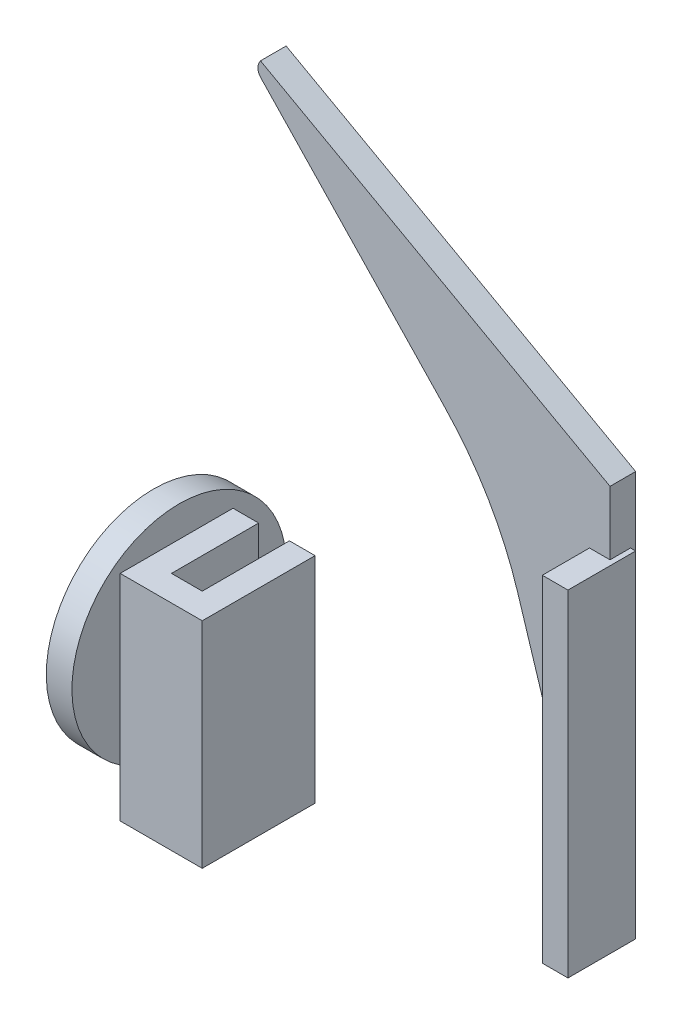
ISO-10303-21;
HEADER;
FILE_DESCRIPTION(('STEP AP214'),'2;1');
FILE_NAME('part.step','',(''),(''),'','','');
FILE_SCHEMA(('AUTOMOTIVE_DESIGN { 1 0 10303 214 1 1 1 1 }'));
ENDSEC;
DATA;
#1=APPLICATION_CONTEXT('core data for automotive mechanical design processes');
#2=APPLICATION_PROTOCOL_DEFINITION('international standard','automotive_design',2000,#1);
#3=PRODUCT_CONTEXT('',#1,'mechanical');
#4=PRODUCT('Part','Part','',(#3));
#5=PRODUCT_RELATED_PRODUCT_CATEGORY('part','',(#4));
#6=PRODUCT_DEFINITION_FORMATION('','',#4);
#7=PRODUCT_DEFINITION_CONTEXT('part definition',#1,'design');
#8=PRODUCT_DEFINITION('design','',#6,#7);
#9=PRODUCT_DEFINITION_SHAPE('','',#8);
#10=(LENGTH_UNIT() NAMED_UNIT(*) SI_UNIT(.MILLI.,.METRE.));
#11=(NAMED_UNIT(*) PLANE_ANGLE_UNIT() SI_UNIT($,.RADIAN.));
#12=(NAMED_UNIT(*) SI_UNIT($,.STERADIAN.) SOLID_ANGLE_UNIT());
#13=UNCERTAINTY_MEASURE_WITH_UNIT(LENGTH_MEASURE(1.E-05),#10,'distance_accuracy_value','');
#14=(GEOMETRIC_REPRESENTATION_CONTEXT(3) GLOBAL_UNCERTAINTY_ASSIGNED_CONTEXT((#13)) GLOBAL_UNIT_ASSIGNED_CONTEXT((#10,
#11,#12)) REPRESENTATION_CONTEXT('',''));
#15=CARTESIAN_POINT('',(0.,0.,0.));
#16=DIRECTION('',(0.,0.,1.));
#17=DIRECTION('',(1.,0.,0.));
#18=AXIS2_PLACEMENT_3D('',#15,#16,#17);
#19=CARTESIAN_POINT('',(336.23110481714,416.899999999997,942.510645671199));
#20=DIRECTION('',(0.,0.,1.));
#21=DIRECTION('',(0.,-1.,0.));
#22=AXIS2_PLACEMENT_3D('',#19,#20,#21);
#23=PLANE('',#22);
#24=DIRECTION('',(0.,-1.,0.));
#25=VECTOR('',#24,1.);
#26=CARTESIAN_POINT('',(320.23110481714,416.899999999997,942.510645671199));
#27=LINE('',#26,#25);
#28=CARTESIAN_POINT('',(320.23110481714,416.899999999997,942.510645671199));
#29=VERTEX_POINT('',#28);
#30=CARTESIAN_POINT('',(320.231104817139,375.099999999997,942.510645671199));
#31=VERTEX_POINT('',#30);
#32=EDGE_CURVE('E47',#29,#31,#27,.T.);
#33=ORIENTED_EDGE('',*,*,#32,.T.);
#34=DIRECTION('',(-1.,0.,0.));
#35=VECTOR('',#34,1.);
#36=CARTESIAN_POINT('',(336.231104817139,375.099999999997,942.510645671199));
#37=LINE('',#36,#35);
#38=CARTESIAN_POINT('',(336.231104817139,375.099999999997,942.510645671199));
#39=VERTEX_POINT('',#38);
#40=EDGE_CURVE('E108',#39,#31,#37,.T.);
#41=ORIENTED_EDGE('',*,*,#40,.F.);
#42=DIRECTION('',(0.,-1.,0.));
#43=VECTOR('',#42,1.);
#44=CARTESIAN_POINT('',(336.23110481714,416.899999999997,942.510645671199));
#45=LINE('',#44,#43);
#46=CARTESIAN_POINT('',(336.23110481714,416.899999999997,942.510645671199));
#47=VERTEX_POINT('',#46);
#48=EDGE_CURVE('E12',#47,#39,#45,.T.);
#49=ORIENTED_EDGE('',*,*,#48,.F.);
#50=DIRECTION('',(-1.,0.,0.));
#51=VECTOR('',#50,1.);
#52=CARTESIAN_POINT('',(336.23110481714,416.899999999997,942.510645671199));
#53=LINE('',#52,#51);
#54=EDGE_CURVE('E109',#47,#29,#53,.T.);
#55=ORIENTED_EDGE('',*,*,#54,.T.);
#56=EDGE_LOOP('',(#33,#41,#49,#55));
#57=FACE_BOUND('',#56,.T.);
#58=ADVANCED_FACE('F44',(#57),#23,.T.);
#59=CARTESIAN_POINT('',(336.23110481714,416.899999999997,942.510645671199));
#60=DIRECTION('',(1.,0.,0.));
#61=DIRECTION('',(0.,1.,0.));
#62=AXIS2_PLACEMENT_3D('',#59,#60,#61);
#63=PLANE('',#62);
#64=ORIENTED_EDGE('',*,*,#48,.T.);
#65=DIRECTION('',(0.,0.,1.));
#66=VECTOR('',#65,1.);
#67=CARTESIAN_POINT('',(336.231104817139,375.099999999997,942.510645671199));
#68=LINE('',#67,#66);
#69=CARTESIAN_POINT('',(336.23110481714,375.099999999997,920.510645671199));
#70=VERTEX_POINT('',#69);
#71=EDGE_CURVE('E126',#70,#39,#68,.T.);
#72=ORIENTED_EDGE('',*,*,#71,.F.);
#73=DIRECTION('',(0.,-1.,0.));
#74=VECTOR('',#73,1.);
#75=CARTESIAN_POINT('',(336.23110481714,416.899999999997,920.510645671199));
#76=LINE('',#75,#74);
#77=CARTESIAN_POINT('',(336.23110481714,416.899999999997,920.510645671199));
#78=VERTEX_POINT('',#77);
#79=EDGE_CURVE('E52',#78,#70,#76,.T.);
#80=ORIENTED_EDGE('',*,*,#79,.F.);
#81=DIRECTION('',(0.,0.,1.));
#82=VECTOR('',#81,1.);
#83=CARTESIAN_POINT('',(336.23110481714,416.899999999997,942.510645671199));
#84=LINE('',#83,#82);
#85=EDGE_CURVE('E114',#78,#47,#84,.T.);
#86=ORIENTED_EDGE('',*,*,#85,.T.);
#87=EDGE_LOOP('',(#64,#72,#80,#86));
#88=FACE_BOUND('',#87,.T.);
#89=ADVANCED_FACE('F190',(#88),#63,.T.);
#90=CARTESIAN_POINT('',(336.23110481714,416.899999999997,920.510645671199));
#91=DIRECTION('',(0.,0.,-1.));
#92=DIRECTION('',(0.,1.,0.));
#93=AXIS2_PLACEMENT_3D('',#90,#91,#92);
#94=PLANE('',#93);
#95=ORIENTED_EDGE('',*,*,#79,.T.);
#96=DIRECTION('',(1.,0.,0.));
#97=VECTOR('',#96,1.);
#98=CARTESIAN_POINT('',(336.23110481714,375.099999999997,920.510645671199));
#99=LINE('',#98,#97);
#100=CARTESIAN_POINT('',(331.23110481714,375.099999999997,920.510645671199));
#101=VERTEX_POINT('',#100);
#102=EDGE_CURVE('E139',#101,#70,#99,.T.);
#103=ORIENTED_EDGE('',*,*,#102,.F.);
#104=DIRECTION('',(0.,-1.,0.));
#105=VECTOR('',#104,1.);
#106=CARTESIAN_POINT('',(331.23110481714,416.899999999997,920.510645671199));
#107=LINE('',#106,#105);
#108=CARTESIAN_POINT('',(331.23110481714,416.899999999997,920.510645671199));
#109=VERTEX_POINT('',#108);
#110=EDGE_CURVE('E161',#109,#101,#107,.T.);
#111=ORIENTED_EDGE('',*,*,#110,.F.);
#112=DIRECTION('',(1.,0.,0.));
#113=VECTOR('',#112,1.);
#114=CARTESIAN_POINT('',(336.23110481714,416.899999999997,920.510645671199));
#115=LINE('',#114,#113);
#116=EDGE_CURVE('E157',#109,#78,#115,.T.);
#117=ORIENTED_EDGE('',*,*,#116,.T.);
#118=EDGE_LOOP('',(#95,#103,#111,#117));
#119=FACE_BOUND('',#118,.T.);
#120=ADVANCED_FACE('F189',(#119),#94,.T.);
#121=CARTESIAN_POINT('',(331.23110481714,416.899999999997,937.510645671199));
#122=DIRECTION('',(-1.,0.,0.));
#123=DIRECTION('',(0.,-1.,0.));
#124=AXIS2_PLACEMENT_3D('',#121,#122,#123);
#125=PLANE('',#124);
#126=ORIENTED_EDGE('',*,*,#110,.T.);
#127=DIRECTION('',(0.,0.,-1.));
#128=VECTOR('',#127,1.);
#129=CARTESIAN_POINT('',(331.231104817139,375.099999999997,937.510645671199));
#130=LINE('',#129,#128);
#131=CARTESIAN_POINT('',(331.231104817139,375.099999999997,937.510645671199));
#132=VERTEX_POINT('',#131);
#133=EDGE_CURVE('E136',#132,#101,#130,.T.);
#134=ORIENTED_EDGE('',*,*,#133,.F.);
#135=DIRECTION('',(0.,-1.,0.));
#136=VECTOR('',#135,1.);
#137=CARTESIAN_POINT('',(331.23110481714,416.899999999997,937.510645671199));
#138=LINE('',#137,#136);
#139=CARTESIAN_POINT('',(331.23110481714,416.899999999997,937.510645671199));
#140=VERTEX_POINT('',#139);
#141=EDGE_CURVE('E163',#140,#132,#138,.T.);
#142=ORIENTED_EDGE('',*,*,#141,.F.);
#143=DIRECTION('',(0.,0.,-1.));
#144=VECTOR('',#143,1.);
#145=CARTESIAN_POINT('',(331.23110481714,416.899999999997,937.510645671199));
#146=LINE('',#145,#144);
#147=EDGE_CURVE('E154',#140,#109,#146,.T.);
#148=ORIENTED_EDGE('',*,*,#147,.T.);
#149=EDGE_LOOP('',(#126,#134,#142,#148));
#150=FACE_BOUND('',#149,.T.);
#151=ADVANCED_FACE('F185',(#150),#125,.T.);
#152=CARTESIAN_POINT('',(331.23110481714,416.899999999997,937.510645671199));
#153=DIRECTION('',(0.,0.,-1.));
#154=DIRECTION('',(0.,1.,0.));
#155=AXIS2_PLACEMENT_3D('',#152,#153,#154);
#156=PLANE('',#155);
#157=ORIENTED_EDGE('',*,*,#141,.T.);
#158=DIRECTION('',(1.,0.,0.));
#159=VECTOR('',#158,1.);
#160=CARTESIAN_POINT('',(331.231104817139,375.099999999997,937.510645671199));
#161=LINE('',#160,#159);
#162=CARTESIAN_POINT('',(325.231104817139,375.099999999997,937.510645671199));
#163=VERTEX_POINT('',#162);
#164=EDGE_CURVE('E133',#163,#132,#161,.T.);
#165=ORIENTED_EDGE('',*,*,#164,.F.);
#166=DIRECTION('',(0.,-1.,0.));
#167=VECTOR('',#166,1.);
#168=CARTESIAN_POINT('',(325.23110481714,416.899999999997,937.510645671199));
#169=LINE('',#168,#167);
#170=CARTESIAN_POINT('',(325.23110481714,416.899999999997,937.510645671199));
#171=VERTEX_POINT('',#170);
#172=EDGE_CURVE('E165',#171,#163,#169,.T.);
#173=ORIENTED_EDGE('',*,*,#172,.F.);
#174=DIRECTION('',(1.,0.,0.));
#175=VECTOR('',#174,1.);
#176=CARTESIAN_POINT('',(331.23110481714,416.899999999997,937.510645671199));
#177=LINE('',#176,#175);
#178=EDGE_CURVE('E151',#171,#140,#177,.T.);
#179=ORIENTED_EDGE('',*,*,#178,.T.);
#180=EDGE_LOOP('',(#157,#165,#173,#179));
#181=FACE_BOUND('',#180,.T.);
#182=ADVANCED_FACE('F178',(#181),#156,.T.);
#183=CARTESIAN_POINT('',(325.23110481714,416.899999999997,937.510645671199));
#184=DIRECTION('',(1.,0.,0.));
#185=DIRECTION('',(0.,1.,0.));
#186=AXIS2_PLACEMENT_3D('',#183,#184,#185);
#187=PLANE('',#186);
#188=ORIENTED_EDGE('',*,*,#172,.T.);
#189=DIRECTION('',(0.,0.,1.));
#190=VECTOR('',#189,1.);
#191=CARTESIAN_POINT('',(325.231104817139,375.099999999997,937.510645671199));
#192=LINE('',#191,#190);
#193=CARTESIAN_POINT('',(325.23110481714,375.099999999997,920.510645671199));
#194=VERTEX_POINT('',#193);
#195=EDGE_CURVE('E130',#194,#163,#192,.T.);
#196=ORIENTED_EDGE('',*,*,#195,.F.);
#197=DIRECTION('',(0.,-1.,0.));
#198=VECTOR('',#197,1.);
#199=CARTESIAN_POINT('',(325.23110481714,416.899999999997,920.510645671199));
#200=LINE('',#199,#198);
#201=CARTESIAN_POINT('',(325.23110481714,416.899999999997,920.510645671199));
#202=VERTEX_POINT('',#201);
#203=EDGE_CURVE('E167',#202,#194,#200,.T.);
#204=ORIENTED_EDGE('',*,*,#203,.F.);
#205=DIRECTION('',(0.,0.,1.));
#206=VECTOR('',#205,1.);
#207=CARTESIAN_POINT('',(325.23110481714,416.899999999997,937.510645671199));
#208=LINE('',#207,#206);
#209=EDGE_CURVE('E148',#202,#171,#208,.T.);
#210=ORIENTED_EDGE('',*,*,#209,.T.);
#211=EDGE_LOOP('',(#188,#196,#204,#210));
#212=FACE_BOUND('',#211,.T.);
#213=ADVANCED_FACE('F175',(#212),#187,.T.);
#214=CARTESIAN_POINT('',(325.23110481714,416.899999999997,920.510645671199));
#215=DIRECTION('',(0.,0.,-1.));
#216=DIRECTION('',(0.,1.,0.));
#217=AXIS2_PLACEMENT_3D('',#214,#215,#216);
#218=PLANE('',#217);
#219=ORIENTED_EDGE('',*,*,#203,.T.);
#220=DIRECTION('',(1.,0.,0.));
#221=VECTOR('',#220,1.);
#222=CARTESIAN_POINT('',(325.23110481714,375.099999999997,920.510645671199));
#223=LINE('',#222,#221);
#224=CARTESIAN_POINT('',(320.23110481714,375.099999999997,920.510645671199));
#225=VERTEX_POINT('',#224);
#226=EDGE_CURVE('E121',#225,#194,#223,.T.);
#227=ORIENTED_EDGE('',*,*,#226,.F.);
#228=DIRECTION('',(0.,-1.,0.));
#229=VECTOR('',#228,1.);
#230=CARTESIAN_POINT('',(320.23110481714,416.899999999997,920.510645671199));
#231=LINE('',#230,#229);
#232=CARTESIAN_POINT('',(320.23110481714,416.899999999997,920.510645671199));
#233=VERTEX_POINT('',#232);
#234=EDGE_CURVE('E113',#233,#225,#231,.T.);
#235=ORIENTED_EDGE('',*,*,#234,.F.);
#236=DIRECTION('',(1.,0.,0.));
#237=VECTOR('',#236,1.);
#238=CARTESIAN_POINT('',(325.23110481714,416.899999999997,920.510645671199));
#239=LINE('',#238,#237);
#240=EDGE_CURVE('E145',#233,#202,#239,.T.);
#241=ORIENTED_EDGE('',*,*,#240,.T.);
#242=EDGE_LOOP('',(#219,#227,#235,#241));
#243=FACE_BOUND('',#242,.T.);
#244=ADVANCED_FACE('F169',(#243),#218,.T.);
#245=CARTESIAN_POINT('',(320.23110481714,416.899999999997,942.510645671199));
#246=DIRECTION('',(-1.,0.,0.));
#247=DIRECTION('',(0.,-1.,0.));
#248=AXIS2_PLACEMENT_3D('',#245,#246,#247);
#249=PLANE('',#248);
#250=ORIENTED_EDGE('',*,*,#234,.T.);
#251=DIRECTION('',(0.,0.,-1.));
#252=VECTOR('',#251,1.);
#253=CARTESIAN_POINT('',(320.231104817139,375.099999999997,942.510645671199));
#254=LINE('',#253,#252);
#255=EDGE_CURVE('E116',#31,#225,#254,.T.);
#256=ORIENTED_EDGE('',*,*,#255,.F.);
#257=ORIENTED_EDGE('',*,*,#32,.F.);
#258=DIRECTION('',(0.,0.,-1.));
#259=VECTOR('',#258,1.);
#260=CARTESIAN_POINT('',(320.23110481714,416.899999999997,942.510645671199));
#261=LINE('',#260,#259);
#262=EDGE_CURVE('E143',#29,#233,#261,.T.);
#263=ORIENTED_EDGE('',*,*,#262,.T.);
#264=EDGE_LOOP('',(#250,#256,#257,#263));
#265=FACE_BOUND('',#264,.T.);
#266=ADVANCED_FACE('F117',(#265),#249,.T.);
#267=CARTESIAN_POINT('',(5.75868655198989E-12,416.900000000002,0.));
#268=DIRECTION('',(0.,-1.,0.));
#269=DIRECTION('',(1.,0.,0.));
#270=AXIS2_PLACEMENT_3D('',#267,#268,#269);
#271=PLANE('',#270);
#272=ORIENTED_EDGE('',*,*,#54,.F.);
#273=ORIENTED_EDGE('',*,*,#85,.F.);
#274=ORIENTED_EDGE('',*,*,#116,.F.);
#275=ORIENTED_EDGE('',*,*,#147,.F.);
#276=ORIENTED_EDGE('',*,*,#178,.F.);
#277=ORIENTED_EDGE('',*,*,#209,.F.);
#278=ORIENTED_EDGE('',*,*,#240,.F.);
#279=ORIENTED_EDGE('',*,*,#262,.F.);
#280=EDGE_LOOP('',(#272,#273,#274,#275,#276,#277,#278,#279));
#281=FACE_BOUND('',#280,.T.);
#282=ADVANCED_FACE('F181',(#281),#271,.F.);
#283=CARTESIAN_POINT('',(5.2325213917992E-12,375.100000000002,0.));
#284=DIRECTION('',(0.,-1.,0.));
#285=DIRECTION('',(1.,0.,0.));
#286=AXIS2_PLACEMENT_3D('',#283,#284,#285);
#287=PLANE('',#286);
#288=ORIENTED_EDGE('',*,*,#40,.T.);
#289=ORIENTED_EDGE('',*,*,#255,.T.);
#290=ORIENTED_EDGE('',*,*,#226,.T.);
#291=ORIENTED_EDGE('',*,*,#195,.T.);
#292=ORIENTED_EDGE('',*,*,#164,.T.);
#293=ORIENTED_EDGE('',*,*,#133,.T.);
#294=ORIENTED_EDGE('',*,*,#102,.T.);
#295=ORIENTED_EDGE('',*,*,#71,.T.);
#296=EDGE_LOOP('',(#288,#289,#290,#291,#292,#293,#294,#295));
#297=FACE_BOUND('',#296,.T.);
#298=ADVANCED_FACE('F124',(#297),#287,.T.);
#299=CLOSED_SHELL('',(#58,#89,#120,#151,#182,#213,#244,#266,#282,#298));
#300=MANIFOLD_SOLID_BREP('B2',#299);
#301=CARTESIAN_POINT('',(355.791475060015,345.339593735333,885.01064567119));
#302=DIRECTION('',(0.954146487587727,0.299340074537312,0.));
#303=DIRECTION('',(-0.299340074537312,0.954146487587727,0.));
#304=AXIS2_PLACEMENT_3D('',#301,#302,#303);
#305=PLANE('',#304);
#306=DIRECTION('',(0.299340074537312,-0.954146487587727,0.));
#307=VECTOR('',#306,1.);
#308=CARTESIAN_POINT('',(355.791475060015,345.339593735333,881.010645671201));
#309=LINE('',#308,#307);
#310=CARTESIAN_POINT('',(354.23110481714,350.313273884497,881.010645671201));
#311=VERTEX_POINT('',#310);
#312=CARTESIAN_POINT('',(355.791475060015,345.339593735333,881.010645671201));
#313=VERTEX_POINT('',#312);
#314=EDGE_CURVE('E300',#311,#313,#309,.T.);
#315=ORIENTED_EDGE('',*,*,#314,.F.);
#316=DIRECTION('',(0.,0.,1.));
#317=VECTOR('',#316,1.);
#318=CARTESIAN_POINT('',(354.23110481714,350.313273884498,885.01064567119));
#319=LINE('',#318,#317);
#320=CARTESIAN_POINT('',(354.23110481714,350.313273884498,885.01064567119));
#321=VERTEX_POINT('',#320);
#322=EDGE_CURVE('E398',#311,#321,#319,.T.);
#323=ORIENTED_EDGE('',*,*,#322,.T.);
#324=DIRECTION('',(0.299340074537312,-0.954146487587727,0.));
#325=VECTOR('',#324,1.);
#326=CARTESIAN_POINT('',(355.791475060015,345.339593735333,885.01064567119));
#327=LINE('',#326,#325);
#328=CARTESIAN_POINT('',(340.231104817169,394.938273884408,885.01064567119));
#329=VERTEX_POINT('',#328);
#330=EDGE_CURVE('E428',#329,#321,#327,.T.);
#331=ORIENTED_EDGE('',*,*,#330,.F.);
#332=DIRECTION('',(0.,0.,-1.));
#333=VECTOR('',#332,1.);
#334=CARTESIAN_POINT('',(340.231104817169,394.938273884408,885.01064567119));
#335=LINE('',#334,#333);
#336=CARTESIAN_POINT('',(340.231104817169,394.938273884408,880.01064567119));
#337=VERTEX_POINT('',#336);
#338=EDGE_CURVE('E482',#329,#337,#335,.T.);
#339=ORIENTED_EDGE('',*,*,#338,.T.);
#340=DIRECTION('',(0.299340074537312,-0.954146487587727,0.));
#341=VECTOR('',#340,1.);
#342=CARTESIAN_POINT('',(355.791475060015,345.339593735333,880.01064567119));
#343=LINE('',#342,#341);
#344=CARTESIAN_POINT('',(355.791475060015,345.339593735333,880.01064567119));
#345=VERTEX_POINT('',#344);
#346=EDGE_CURVE('E444',#337,#345,#343,.T.);
#347=ORIENTED_EDGE('',*,*,#346,.T.);
#348=DIRECTION('',(0.,0.,-1.));
#349=VECTOR('',#348,1.);
#350=CARTESIAN_POINT('',(355.791475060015,345.339593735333,885.01064567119));
#351=LINE('',#350,#349);
#352=EDGE_CURVE('E480',#313,#345,#351,.T.);
#353=ORIENTED_EDGE('',*,*,#352,.F.);
#354=EDGE_LOOP('',(#315,#323,#331,#339,#347,#353));
#355=FACE_BOUND('',#354,.T.);
#356=ADVANCED_FACE('F285',(#355),#305,.F.);
#357=CARTESIAN_POINT('',(357.69976803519,345.938273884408,885.01064567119));
#358=DIRECTION('',(0.,0.,-1.));
#359=DIRECTION('',(-1.,0.,0.));
#360=AXIS2_PLACEMENT_3D('',#357,#358,#359);
#361=CYLINDRICAL_SURFACE('',#360,2.00000000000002);
#362=CARTESIAN_POINT('',(357.69976803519,345.938273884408,881.010645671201));
#363=DIRECTION('',(0.,0.,1.));
#364=DIRECTION('',(1.,0.,0.));
#365=AXIS2_PLACEMENT_3D('',#362,#363,#364);
#366=CIRCLE('',#365,2.00000000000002);
#367=CARTESIAN_POINT('',(357.69976803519,343.938273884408,881.010645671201));
#368=VERTEX_POINT('',#367);
#369=EDGE_CURVE('E308',#313,#368,#366,.T.);
#370=ORIENTED_EDGE('',*,*,#369,.F.);
#371=ORIENTED_EDGE('',*,*,#352,.T.);
#372=CARTESIAN_POINT('',(357.69976803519,345.938273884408,880.01064567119));
#373=DIRECTION('',(0.,0.,1.));
#374=DIRECTION('',(1.,0.,0.));
#375=AXIS2_PLACEMENT_3D('',#372,#373,#374);
#376=CIRCLE('',#375,2.00000000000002);
#377=CARTESIAN_POINT('',(357.69976803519,343.938273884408,880.01064567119));
#378=VERTEX_POINT('',#377);
#379=EDGE_CURVE('E447',#345,#378,#376,.T.);
#380=ORIENTED_EDGE('',*,*,#379,.T.);
#381=DIRECTION('',(0.,0.,-1.));
#382=VECTOR('',#381,1.);
#383=CARTESIAN_POINT('',(357.69976803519,343.938273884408,885.01064567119));
#384=LINE('',#383,#382);
#385=EDGE_CURVE('E478',#368,#378,#384,.T.);
#386=ORIENTED_EDGE('',*,*,#385,.F.);
#387=EDGE_LOOP('',(#370,#371,#380,#386));
#388=FACE_BOUND('',#387,.T.);
#389=ADVANCED_FACE('F556',(#388),#361,.T.);
#390=CARTESIAN_POINT('',(358.231104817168,343.938273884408,885.01064567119));
#391=DIRECTION('',(-1.,0.,0.));
#392=DIRECTION('',(0.,-1.,0.));
#393=AXIS2_PLACEMENT_3D('',#390,#391,#392);
#394=PLANE('',#393);
#395=DIRECTION('',(0.,1.,0.));
#396=VECTOR('',#395,1.);
#397=CARTESIAN_POINT('',(358.231104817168,343.938273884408,881.010645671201));
#398=LINE('',#397,#396);
#399=CARTESIAN_POINT('',(358.231104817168,343.938273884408,881.010645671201));
#400=VERTEX_POINT('',#399);
#401=CARTESIAN_POINT('',(358.231104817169,409.438273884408,881.010645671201));
#402=VERTEX_POINT('',#401);
#403=EDGE_CURVE('E42',#400,#402,#398,.T.);
#404=ORIENTED_EDGE('',*,*,#403,.F.);
#405=DIRECTION('',(0.,0.,-1.));
#406=VECTOR('',#405,1.);
#407=CARTESIAN_POINT('',(358.231104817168,343.938273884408,885.01064567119));
#408=LINE('',#407,#406);
#409=CARTESIAN_POINT('',(358.231104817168,343.938273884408,880.01064567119));
#410=VERTEX_POINT('',#409);
#411=EDGE_CURVE('E476',#400,#410,#408,.T.);
#412=ORIENTED_EDGE('',*,*,#411,.T.);
#413=DIRECTION('',(0.,1.,0.));
#414=VECTOR('',#413,1.);
#415=CARTESIAN_POINT('',(358.231104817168,343.938273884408,880.01064567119));
#416=LINE('',#415,#414);
#417=CARTESIAN_POINT('',(358.231104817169,421.849228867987,880.01064567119));
#418=VERTEX_POINT('',#417);
#419=EDGE_CURVE('E453',#410,#418,#416,.T.);
#420=ORIENTED_EDGE('',*,*,#419,.T.);
#421=DIRECTION('',(0.,0.,-1.));
#422=VECTOR('',#421,1.);
#423=CARTESIAN_POINT('',(358.231104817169,421.849228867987,885.01064567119));
#424=LINE('',#423,#422);
#425=CARTESIAN_POINT('',(358.231104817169,421.849228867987,885.01064567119));
#426=VERTEX_POINT('',#425);
#427=EDGE_CURVE('E473',#426,#418,#424,.T.);
#428=ORIENTED_EDGE('',*,*,#427,.F.);
#429=DIRECTION('',(0.,1.,0.));
#430=VECTOR('',#429,1.);
#431=CARTESIAN_POINT('',(358.231104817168,343.938273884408,885.01064567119));
#432=LINE('',#431,#430);
#433=CARTESIAN_POINT('',(358.231104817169,409.438273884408,885.01064567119));
#434=VERTEX_POINT('',#433);
#435=EDGE_CURVE('E431',#434,#426,#432,.T.);
#436=ORIENTED_EDGE('',*,*,#435,.F.);
#437=DIRECTION('',(0.,0.,1.));
#438=VECTOR('',#437,1.);
#439=CARTESIAN_POINT('',(358.231104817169,409.438273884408,885.01064567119));
#440=LINE('',#439,#438);
#441=EDGE_CURVE('E415',#402,#434,#440,.T.);
#442=ORIENTED_EDGE('',*,*,#441,.F.);
#443=EDGE_LOOP('',(#404,#412,#420,#428,#436,#442));
#444=FACE_BOUND('',#443,.T.);
#445=ADVANCED_FACE('F495',(#444),#394,.F.);
#446=CARTESIAN_POINT('',(280.997584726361,376.355208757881,885.01064567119));
#447=DIRECTION('',(0.,0.,1.));
#448=DIRECTION('',(1.,0.,0.));
#449=AXIS2_PLACEMENT_3D('',#446,#447,#448);
#450=PLANE('',#449);
#451=DIRECTION('',(0.,-1.,0.));
#452=VECTOR('',#451,1.);
#453=CARTESIAN_POINT('',(354.23110481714,376.35520875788,885.01064567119));
#454=LINE('',#453,#452);
#455=CARTESIAN_POINT('',(354.231104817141,409.438273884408,885.01064567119));
#456=VERTEX_POINT('',#455);
#457=EDGE_CURVE('E485',#456,#321,#454,.T.);
#458=ORIENTED_EDGE('',*,*,#457,.F.);
#459=DIRECTION('',(1.,0.,0.));
#460=VECTOR('',#459,1.);
#461=CARTESIAN_POINT('',(280.997584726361,409.438273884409,885.01064567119));
#462=LINE('',#461,#460);
#463=EDGE_CURVE('E293',#456,#434,#462,.T.);
#464=ORIENTED_EDGE('',*,*,#463,.T.);
#465=ORIENTED_EDGE('',*,*,#435,.T.);
#466=DIRECTION('',(-0.874619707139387,0.484809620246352,0.));
#467=VECTOR('',#466,1.);
#468=CARTESIAN_POINT('',(358.231104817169,421.849228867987,885.01064567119));
#469=LINE('',#468,#467);
#470=CARTESIAN_POINT('',(290.088648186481,459.621209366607,885.01064567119));
#471=VERTEX_POINT('',#470);
#472=EDGE_CURVE('E433',#426,#471,#469,.T.);
#473=ORIENTED_EDGE('',*,*,#472,.T.);
#474=DIRECTION('',(-0.48480962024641,-0.874619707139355,0.));
#475=VECTOR('',#474,1.);
#476=CARTESIAN_POINT('',(289.831051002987,459.156491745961,885.01064567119));
#477=LINE('',#476,#475);
#478=CARTESIAN_POINT('',(289.831051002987,459.156491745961,885.01064567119));
#479=VERTEX_POINT('',#478);
#480=EDGE_CURVE('E435',#471,#479,#477,.T.);
#481=ORIENTED_EDGE('',*,*,#480,.T.);
#482=CARTESIAN_POINT('',(291.580290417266,458.186872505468,885.01064567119));
#483=DIRECTION('',(0.,0.,1.));
#484=DIRECTION('',(1.,0.,0.));
#485=AXIS2_PLACEMENT_3D('',#482,#483,#484);
#486=CIRCLE('',#485,1.99999999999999);
#487=CARTESIAN_POINT('',(290.131514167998,456.808087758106,885.01064567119));
#488=VERTEX_POINT('',#487);
#489=EDGE_CURVE('E437',#479,#488,#486,.T.);
#490=ORIENTED_EDGE('',*,*,#489,.T.);
#491=DIRECTION('',(0.689392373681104,-0.724388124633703,0.));
#492=VECTOR('',#491,1.);
#493=CARTESIAN_POINT('',(325.967680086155,419.152764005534,885.01064567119));
#494=LINE('',#493,#492);
#495=CARTESIAN_POINT('',(325.967680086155,419.152764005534,885.01064567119));
#496=VERTEX_POINT('',#495);
#497=EDGE_CURVE('E439',#488,#496,#494,.T.);
#498=ORIENTED_EDGE('',*,*,#497,.T.);
#499=CARTESIAN_POINT('',(280.997584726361,376.355208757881,885.01064567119));
#500=DIRECTION('',(0.,0.,-1.));
#501=DIRECTION('',(1.,0.,0.));
#502=AXIS2_PLACEMENT_3D('',#499,#500,#501);
#503=CIRCLE('',#502,62.080111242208);
#504=EDGE_CURVE('E425',#496,#329,#503,.T.);
#505=ORIENTED_EDGE('',*,*,#504,.T.);
#506=ORIENTED_EDGE('',*,*,#330,.T.);
#507=EDGE_LOOP('',(#458,#464,#465,#473,#481,#490,#498,#505,#506));
#508=FACE_BOUND('',#507,.T.);
#509=ADVANCED_FACE('F489',(#508),#450,.T.);
#510=CARTESIAN_POINT('',(280.997584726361,376.355208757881,885.01064567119));
#511=DIRECTION('',(0.,0.,-1.));
#512=DIRECTION('',(-1.,0.,0.));
#513=AXIS2_PLACEMENT_3D('',#510,#511,#512);
#514=CYLINDRICAL_SURFACE('',#513,62.080111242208);
#515=CARTESIAN_POINT('',(280.997584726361,376.355208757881,880.01064567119));
#516=DIRECTION('',(0.,0.,-1.));
#517=DIRECTION('',(1.,0.,0.));
#518=AXIS2_PLACEMENT_3D('',#515,#516,#517);
#519=CIRCLE('',#518,62.080111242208);
#520=CARTESIAN_POINT('',(325.967680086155,419.152764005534,880.01064567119));
#521=VERTEX_POINT('',#520);
#522=EDGE_CURVE('E424',#521,#337,#519,.T.);
#523=ORIENTED_EDGE('',*,*,#522,.T.);
#524=ORIENTED_EDGE('',*,*,#338,.F.);
#525=ORIENTED_EDGE('',*,*,#504,.F.);
#526=DIRECTION('',(0.,0.,-1.));
#527=VECTOR('',#526,1.);
#528=CARTESIAN_POINT('',(325.967680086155,419.152764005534,885.01064567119));
#529=LINE('',#528,#527);
#530=EDGE_CURVE('E441',#496,#521,#529,.T.);
#531=ORIENTED_EDGE('',*,*,#530,.T.);
#532=EDGE_LOOP('',(#523,#524,#525,#531));
#533=FACE_BOUND('',#532,.T.);
#534=ADVANCED_FACE('F287',(#533),#514,.F.);
#535=CARTESIAN_POINT('',(358.231104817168,343.938273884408,885.01064567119));
#536=DIRECTION('',(0.,1.,0.));
#537=DIRECTION('',(0.,0.,1.));
#538=AXIS2_PLACEMENT_3D('',#535,#536,#537);
#539=PLANE('',#538);
#540=DIRECTION('',(1.,0.,0.));
#541=VECTOR('',#540,1.);
#542=CARTESIAN_POINT('',(354.23110481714,343.938273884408,881.010645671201));
#543=LINE('',#542,#541);
#544=CARTESIAN_POINT('',(354.23110481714,343.938273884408,881.010645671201));
#545=VERTEX_POINT('',#544);
#546=EDGE_CURVE('E406',#545,#368,#543,.T.);
#547=ORIENTED_EDGE('',*,*,#546,.T.);
#548=ORIENTED_EDGE('',*,*,#385,.T.);
#549=DIRECTION('',(1.,0.,0.));
#550=VECTOR('',#549,1.);
#551=CARTESIAN_POINT('',(358.231104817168,343.938273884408,880.01064567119));
#552=LINE('',#551,#550);
#553=EDGE_CURVE('E450',#378,#410,#552,.T.);
#554=ORIENTED_EDGE('',*,*,#553,.T.);
#555=ORIENTED_EDGE('',*,*,#411,.F.);
#556=CARTESIAN_POINT('',(359.23110481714,343.938273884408,881.010645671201));
#557=VERTEX_POINT('',#556);
#558=EDGE_CURVE('E413',#400,#557,#543,.T.);
#559=ORIENTED_EDGE('',*,*,#558,.T.);
#560=DIRECTION('',(0.,0.,1.));
#561=VECTOR('',#560,1.);
#562=CARTESIAN_POINT('',(359.23110481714,343.938273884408,881.010645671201));
#563=LINE('',#562,#561);
#564=CARTESIAN_POINT('',(359.23110481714,343.938273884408,894.210645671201));
#565=VERTEX_POINT('',#564);
#566=EDGE_CURVE('E514',#557,#565,#563,.T.);
#567=ORIENTED_EDGE('',*,*,#566,.T.);
#568=DIRECTION('',(1.,0.,0.));
#569=VECTOR('',#568,1.);
#570=CARTESIAN_POINT('',(354.23110481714,343.938273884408,894.210645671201));
#571=LINE('',#570,#569);
#572=CARTESIAN_POINT('',(354.23110481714,343.938273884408,894.210645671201));
#573=VERTEX_POINT('',#572);
#574=EDGE_CURVE('E408',#573,#565,#571,.T.);
#575=ORIENTED_EDGE('',*,*,#574,.F.);
#576=DIRECTION('',(0.,0.,1.));
#577=VECTOR('',#576,1.);
#578=CARTESIAN_POINT('',(354.23110481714,343.938273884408,881.010645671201));
#579=LINE('',#578,#577);
#580=EDGE_CURVE('E395',#545,#573,#579,.T.);
#581=ORIENTED_EDGE('',*,*,#580,.F.);
#582=EDGE_LOOP('',(#547,#548,#554,#555,#559,#567,#575,#581));
#583=FACE_BOUND('',#582,.T.);
#584=ADVANCED_FACE('F405',(#583),#539,.F.);
#585=CARTESIAN_POINT('',(358.231104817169,421.849228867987,885.01064567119));
#586=DIRECTION('',(-0.484809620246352,-0.874619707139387,0.));
#587=DIRECTION('',(0.874619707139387,-0.484809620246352,0.));
#588=AXIS2_PLACEMENT_3D('',#585,#586,#587);
#589=PLANE('',#588);
#590=DIRECTION('',(-0.874619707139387,0.484809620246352,0.));
#591=VECTOR('',#590,1.);
#592=CARTESIAN_POINT('',(358.231104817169,421.849228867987,880.01064567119));
#593=LINE('',#592,#591);
#594=CARTESIAN_POINT('',(290.088648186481,459.621209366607,880.01064567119));
#595=VERTEX_POINT('',#594);
#596=EDGE_CURVE('E455',#418,#595,#593,.T.);
#597=ORIENTED_EDGE('',*,*,#596,.T.);
#598=DIRECTION('',(0.,0.,-1.));
#599=VECTOR('',#598,1.);
#600=CARTESIAN_POINT('',(290.088648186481,459.621209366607,885.01064567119));
#601=LINE('',#600,#599);
#602=EDGE_CURVE('E470',#471,#595,#601,.T.);
#603=ORIENTED_EDGE('',*,*,#602,.F.);
#604=ORIENTED_EDGE('',*,*,#472,.F.);
#605=ORIENTED_EDGE('',*,*,#427,.T.);
#606=EDGE_LOOP('',(#597,#603,#604,#605));
#607=FACE_BOUND('',#606,.T.);
#608=ADVANCED_FACE('F533',(#607),#589,.F.);
#609=CARTESIAN_POINT('',(289.831051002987,459.156491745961,885.01064567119));
#610=DIRECTION('',(0.874619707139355,-0.48480962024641,0.));
#611=DIRECTION('',(0.48480962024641,0.874619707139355,0.));
#612=AXIS2_PLACEMENT_3D('',#609,#610,#611);
#613=PLANE('',#612);
#614=DIRECTION('',(-0.48480962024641,-0.874619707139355,0.));
#615=VECTOR('',#614,1.);
#616=CARTESIAN_POINT('',(289.831051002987,459.156491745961,880.01064567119));
#617=LINE('',#616,#615);
#618=CARTESIAN_POINT('',(289.831051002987,459.156491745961,880.01064567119));
#619=VERTEX_POINT('',#618);
#620=EDGE_CURVE('E457',#595,#619,#617,.T.);
#621=ORIENTED_EDGE('',*,*,#620,.T.);
#622=DIRECTION('',(0.,0.,-1.));
#623=VECTOR('',#622,1.);
#624=CARTESIAN_POINT('',(289.831051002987,459.156491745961,885.01064567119));
#625=LINE('',#624,#623);
#626=EDGE_CURVE('E467',#479,#619,#625,.T.);
#627=ORIENTED_EDGE('',*,*,#626,.F.);
#628=ORIENTED_EDGE('',*,*,#480,.F.);
#629=ORIENTED_EDGE('',*,*,#602,.T.);
#630=EDGE_LOOP('',(#621,#627,#628,#629));
#631=FACE_BOUND('',#630,.T.);
#632=ADVANCED_FACE('F542',(#631),#613,.F.);
#633=CARTESIAN_POINT('',(291.580290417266,458.186872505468,885.01064567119));
#634=DIRECTION('',(0.,0.,-1.));
#635=DIRECTION('',(-1.,0.,0.));
#636=AXIS2_PLACEMENT_3D('',#633,#634,#635);
#637=CYLINDRICAL_SURFACE('',#636,1.99999999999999);
#638=CARTESIAN_POINT('',(291.580290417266,458.186872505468,880.01064567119));
#639=DIRECTION('',(0.,0.,1.));
#640=DIRECTION('',(1.,0.,0.));
#641=AXIS2_PLACEMENT_3D('',#638,#639,#640);
#642=CIRCLE('',#641,1.99999999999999);
#643=CARTESIAN_POINT('',(290.131514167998,456.808087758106,880.01064567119));
#644=VERTEX_POINT('',#643);
#645=EDGE_CURVE('E459',#619,#644,#642,.T.);
#646=ORIENTED_EDGE('',*,*,#645,.T.);
#647=DIRECTION('',(0.,0.,-1.));
#648=VECTOR('',#647,1.);
#649=CARTESIAN_POINT('',(290.131514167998,456.808087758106,885.01064567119));
#650=LINE('',#649,#648);
#651=EDGE_CURVE('E464',#488,#644,#650,.T.);
#652=ORIENTED_EDGE('',*,*,#651,.F.);
#653=ORIENTED_EDGE('',*,*,#489,.F.);
#654=ORIENTED_EDGE('',*,*,#626,.T.);
#655=EDGE_LOOP('',(#646,#652,#653,#654));
#656=FACE_BOUND('',#655,.T.);
#657=ADVANCED_FACE('F546',(#656),#637,.T.);
#658=CARTESIAN_POINT('',(325.967680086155,419.152764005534,885.01064567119));
#659=DIRECTION('',(0.724388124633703,0.689392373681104,0.));
#660=DIRECTION('',(-0.689392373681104,0.724388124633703,0.));
#661=AXIS2_PLACEMENT_3D('',#658,#659,#660);
#662=PLANE('',#661);
#663=DIRECTION('',(0.689392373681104,-0.724388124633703,0.));
#664=VECTOR('',#663,1.);
#665=CARTESIAN_POINT('',(325.967680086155,419.152764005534,880.01064567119));
#666=LINE('',#665,#664);
#667=EDGE_CURVE('E429',#644,#521,#666,.T.);
#668=ORIENTED_EDGE('',*,*,#667,.T.);
#669=ORIENTED_EDGE('',*,*,#530,.F.);
#670=ORIENTED_EDGE('',*,*,#497,.F.);
#671=ORIENTED_EDGE('',*,*,#651,.T.);
#672=EDGE_LOOP('',(#668,#669,#670,#671));
#673=FACE_BOUND('',#672,.T.);
#674=ADVANCED_FACE('F553',(#673),#662,.F.);
#675=CARTESIAN_POINT('',(280.997584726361,376.355208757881,880.01064567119));
#676=DIRECTION('',(0.,0.,1.));
#677=DIRECTION('',(1.,0.,0.));
#678=AXIS2_PLACEMENT_3D('',#675,#676,#677);
#679=PLANE('',#678);
#680=ORIENTED_EDGE('',*,*,#522,.F.);
#681=ORIENTED_EDGE('',*,*,#667,.F.);
#682=ORIENTED_EDGE('',*,*,#645,.F.);
#683=ORIENTED_EDGE('',*,*,#620,.F.);
#684=ORIENTED_EDGE('',*,*,#596,.F.);
#685=ORIENTED_EDGE('',*,*,#419,.F.);
#686=ORIENTED_EDGE('',*,*,#553,.F.);
#687=ORIENTED_EDGE('',*,*,#379,.F.);
#688=ORIENTED_EDGE('',*,*,#346,.F.);
#689=EDGE_LOOP('',(#680,#681,#682,#683,#684,#685,#686,#687,#688));
#690=FACE_BOUND('',#689,.T.);
#691=ADVANCED_FACE('F537',(#690),#679,.F.);
#692=CARTESIAN_POINT('',(354.231104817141,409.438273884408,881.010645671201));
#693=DIRECTION('',(0.,0.,1.));
#694=DIRECTION('',(1.,0.,0.));
#695=AXIS2_PLACEMENT_3D('',#692,#693,#694);
#696=PLANE('',#695);
#697=DIRECTION('',(0.,-1.,0.));
#698=VECTOR('',#697,1.);
#699=CARTESIAN_POINT('',(354.231104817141,409.438273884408,881.010645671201));
#700=LINE('',#699,#698);
#701=EDGE_CURVE('E392',#311,#545,#700,.T.);
#702=ORIENTED_EDGE('',*,*,#701,.F.);
#703=ORIENTED_EDGE('',*,*,#314,.T.);
#704=ORIENTED_EDGE('',*,*,#369,.T.);
#705=ORIENTED_EDGE('',*,*,#546,.F.);
#706=EDGE_LOOP('',(#702,#703,#704,#705));
#707=FACE_BOUND('',#706,.T.);
#708=ADVANCED_FACE('F412',(#707),#696,.F.);
#709=ORIENTED_EDGE('',*,*,#558,.F.);
#710=ORIENTED_EDGE('',*,*,#403,.T.);
#711=DIRECTION('',(1.,0.,0.));
#712=VECTOR('',#711,1.);
#713=CARTESIAN_POINT('',(354.231104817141,409.438273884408,881.010645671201));
#714=LINE('',#713,#712);
#715=CARTESIAN_POINT('',(359.231104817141,409.438273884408,881.010645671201));
#716=VERTEX_POINT('',#715);
#717=EDGE_CURVE('E500',#402,#716,#714,.T.);
#718=ORIENTED_EDGE('',*,*,#717,.T.);
#719=DIRECTION('',(0.,-1.,0.));
#720=VECTOR('',#719,1.);
#721=CARTESIAN_POINT('',(359.231104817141,409.438273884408,881.010645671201));
#722=LINE('',#721,#720);
#723=EDGE_CURVE('E516',#716,#557,#722,.T.);
#724=ORIENTED_EDGE('',*,*,#723,.T.);
#725=EDGE_LOOP('',(#709,#710,#718,#724));
#726=FACE_BOUND('',#725,.T.);
#727=ADVANCED_FACE('F526',(#726),#696,.F.);
#728=CARTESIAN_POINT('',(354.231104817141,409.438273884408,881.010645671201));
#729=DIRECTION('',(0.,-1.,0.));
#730=DIRECTION('',(1.,0.,0.));
#731=AXIS2_PLACEMENT_3D('',#728,#729,#730);
#732=PLANE('',#731);
#733=ORIENTED_EDGE('',*,*,#717,.F.);
#734=ORIENTED_EDGE('',*,*,#441,.T.);
#735=ORIENTED_EDGE('',*,*,#463,.F.);
#736=DIRECTION('',(0.,0.,-1.));
#737=VECTOR('',#736,1.);
#738=CARTESIAN_POINT('',(354.231104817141,409.438273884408,881.010645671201));
#739=LINE('',#738,#737);
#740=CARTESIAN_POINT('',(354.23110481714,409.438273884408,894.210645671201));
#741=VERTEX_POINT('',#740);
#742=EDGE_CURVE('E507',#741,#456,#739,.T.);
#743=ORIENTED_EDGE('',*,*,#742,.F.);
#744=DIRECTION('',(1.,0.,0.));
#745=VECTOR('',#744,1.);
#746=CARTESIAN_POINT('',(354.23110481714,409.438273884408,894.210645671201));
#747=LINE('',#746,#745);
#748=CARTESIAN_POINT('',(359.23110481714,409.438273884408,894.210645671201));
#749=VERTEX_POINT('',#748);
#750=EDGE_CURVE('E506',#741,#749,#747,.T.);
#751=ORIENTED_EDGE('',*,*,#750,.T.);
#752=DIRECTION('',(0.,0.,-1.));
#753=VECTOR('',#752,1.);
#754=CARTESIAN_POINT('',(359.231104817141,409.438273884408,881.010645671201));
#755=LINE('',#754,#753);
#756=EDGE_CURVE('E401',#749,#716,#755,.T.);
#757=ORIENTED_EDGE('',*,*,#756,.T.);
#758=EDGE_LOOP('',(#733,#734,#735,#743,#751,#757));
#759=FACE_BOUND('',#758,.T.);
#760=ADVANCED_FACE('F498',(#759),#732,.F.);
#761=CARTESIAN_POINT('',(354.231104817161,-4.80732729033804E-12,1.04232105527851E-11));
#762=DIRECTION('',(-1.,0.,0.));
#763=DIRECTION('',(0.,0.,1.));
#764=AXIS2_PLACEMENT_3D('',#761,#762,#763);
#765=PLANE('',#764);
#766=ORIENTED_EDGE('',*,*,#322,.F.);
#767=ORIENTED_EDGE('',*,*,#701,.T.);
#768=ORIENTED_EDGE('',*,*,#580,.T.);
#769=DIRECTION('',(0.,1.,0.));
#770=VECTOR('',#769,1.);
#771=CARTESIAN_POINT('',(354.23110481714,343.938273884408,894.210645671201));
#772=LINE('',#771,#770);
#773=EDGE_CURVE('E410',#573,#741,#772,.T.);
#774=ORIENTED_EDGE('',*,*,#773,.T.);
#775=ORIENTED_EDGE('',*,*,#742,.T.);
#776=ORIENTED_EDGE('',*,*,#457,.T.);
#777=EDGE_LOOP('',(#766,#767,#768,#774,#775,#776));
#778=FACE_BOUND('',#777,.T.);
#779=ADVANCED_FACE('F394',(#778),#765,.T.);
#780=CARTESIAN_POINT('',(354.23110481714,343.938273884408,894.210645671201));
#781=DIRECTION('',(0.,0.,-1.));
#782=DIRECTION('',(-1.,0.,0.));
#783=AXIS2_PLACEMENT_3D('',#780,#781,#782);
#784=PLANE('',#783);
#785=DIRECTION('',(0.,1.,0.));
#786=VECTOR('',#785,1.);
#787=CARTESIAN_POINT('',(359.23110481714,343.938273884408,894.210645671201));
#788=LINE('',#787,#786);
#789=EDGE_CURVE('E512',#565,#749,#788,.T.);
#790=ORIENTED_EDGE('',*,*,#789,.T.);
#791=ORIENTED_EDGE('',*,*,#750,.F.);
#792=ORIENTED_EDGE('',*,*,#773,.F.);
#793=ORIENTED_EDGE('',*,*,#574,.T.);
#794=EDGE_LOOP('',(#790,#791,#792,#793));
#795=FACE_BOUND('',#794,.T.);
#796=ADVANCED_FACE('F520',(#795),#784,.F.);
#797=CARTESIAN_POINT('',(359.231104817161,-4.87116511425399E-12,1.05749488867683E-11));
#798=DIRECTION('',(-1.,0.,0.));
#799=DIRECTION('',(0.,0.,1.));
#800=AXIS2_PLACEMENT_3D('',#797,#798,#799);
#801=PLANE('',#800);
#802=ORIENTED_EDGE('',*,*,#723,.F.);
#803=ORIENTED_EDGE('',*,*,#756,.F.);
#804=ORIENTED_EDGE('',*,*,#789,.F.);
#805=ORIENTED_EDGE('',*,*,#566,.F.);
#806=EDGE_LOOP('',(#802,#803,#804,#805));
#807=FACE_BOUND('',#806,.T.);
#808=ADVANCED_FACE('F523',(#807),#801,.F.);
#809=CLOSED_SHELL('',(#356,#389,#445,#509,#534,#584,#608,#632,#657,#674,#691,#708,#727,#760,
#779,#796,#808));
#810=MANIFOLD_SOLID_BREP('B6',#809);
#811=CARTESIAN_POINT('',(314.23110481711,395.999999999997,925.010645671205));
#812=DIRECTION('',(1.,0.,0.));
#813=DIRECTION('',(0.,1.,0.));
#814=AXIS2_PLACEMENT_3D('',#811,#812,#813);
#815=PLANE('',#814);
#816=CARTESIAN_POINT('',(314.23110481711,395.999999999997,925.010645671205));
#817=DIRECTION('',(1.,0.,0.));
#818=DIRECTION('',(0.,1.,0.));
#819=AXIS2_PLACEMENT_3D('',#816,#817,#818);
#820=CIRCLE('',#819,20.9);
#821=CARTESIAN_POINT('',(314.23110481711,416.899999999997,925.010645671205));
#822=VERTEX_POINT('',#821);
#823=EDGE_CURVE('E284',#822,#822,#820,.T.);
#824=ORIENTED_EDGE('',*,*,#823,.T.);
#825=EDGE_LOOP('',(#824));
#826=FACE_BOUND('',#825,.T.);
#827=CARTESIAN_POINT('',(314.23110481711,395.999999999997,918.010645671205));
#828=DIRECTION('',(1.,0.,0.));
#829=DIRECTION('',(0.,1.,0.));
#830=AXIS2_PLACEMENT_3D('',#827,#828,#829);
#831=CIRCLE('',#830,5.99999999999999);
#832=CARTESIAN_POINT('',(314.23110481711,401.999999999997,918.010645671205));
#833=VERTEX_POINT('',#832);
#834=EDGE_CURVE('E707',#833,#833,#831,.T.);
#835=ORIENTED_EDGE('',*,*,#834,.F.);
#836=EDGE_LOOP('',(#835));
#837=FACE_BOUND('',#836,.T.);
#838=ADVANCED_FACE('F696',(#826,#837),#815,.T.);
#839=CARTESIAN_POINT('',(309.23110481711,395.999999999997,925.010645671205));
#840=DIRECTION('',(1.,0.,0.));
#841=DIRECTION('',(0.,1.,0.));
#842=AXIS2_PLACEMENT_3D('',#839,#840,#841);
#843=PLANE('',#842);
#844=CARTESIAN_POINT('',(309.23110481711,395.999999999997,925.010645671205));
#845=DIRECTION('',(1.,0.,0.));
#846=DIRECTION('',(0.,1.,0.));
#847=AXIS2_PLACEMENT_3D('',#844,#845,#846);
#848=CIRCLE('',#847,20.9);
#849=CARTESIAN_POINT('',(309.23110481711,416.899999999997,925.010645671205));
#850=VERTEX_POINT('',#849);
#851=EDGE_CURVE('E700',#850,#850,#848,.T.);
#852=ORIENTED_EDGE('',*,*,#851,.F.);
#853=EDGE_LOOP('',(#852));
#854=FACE_BOUND('',#853,.T.);
#855=CARTESIAN_POINT('',(309.23110481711,395.999999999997,918.010645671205));
#856=DIRECTION('',(1.,0.,0.));
#857=DIRECTION('',(0.,1.,0.));
#858=AXIS2_PLACEMENT_3D('',#855,#856,#857);
#859=CIRCLE('',#858,5.99999999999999);
#860=CARTESIAN_POINT('',(309.23110481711,401.999999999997,918.010645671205));
#861=VERTEX_POINT('',#860);
#862=EDGE_CURVE('E709',#861,#861,#859,.T.);
#863=ORIENTED_EDGE('',*,*,#862,.T.);
#864=EDGE_LOOP('',(#863));
#865=FACE_BOUND('',#864,.T.);
#866=ADVANCED_FACE('F719',(#854,#865),#843,.F.);
#867=CARTESIAN_POINT('',(314.23110481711,395.999999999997,925.010645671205));
#868=DIRECTION('',(-1.,0.,0.));
#869=DIRECTION('',(0.,-1.,0.));
#870=AXIS2_PLACEMENT_3D('',#867,#868,#869);
#871=CYLINDRICAL_SURFACE('',#870,20.9);
#872=ORIENTED_EDGE('',*,*,#823,.F.);
#873=EDGE_LOOP('',(#872));
#874=FACE_BOUND('',#873,.T.);
#875=ORIENTED_EDGE('',*,*,#851,.T.);
#876=EDGE_LOOP('',(#875));
#877=FACE_BOUND('',#876,.T.);
#878=ADVANCED_FACE('F698',(#874,#877),#871,.T.);
#879=CARTESIAN_POINT('',(314.23110481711,395.999999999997,918.010645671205));
#880=DIRECTION('',(-1.,0.,0.));
#881=DIRECTION('',(0.,-1.,0.));
#882=AXIS2_PLACEMENT_3D('',#879,#880,#881);
#883=CYLINDRICAL_SURFACE('',#882,5.99999999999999);
#884=ORIENTED_EDGE('',*,*,#834,.T.);
#885=EDGE_LOOP('',(#884));
#886=FACE_BOUND('',#885,.T.);
#887=ORIENTED_EDGE('',*,*,#862,.F.);
#888=EDGE_LOOP('',(#887));
#889=FACE_BOUND('',#888,.T.);
#890=ADVANCED_FACE('F715',(#886,#889),#883,.F.);
#891=CLOSED_SHELL('',(#838,#866,#878,#890));
#892=MANIFOLD_SOLID_BREP('B36',#891);
#893=ADVANCED_BREP_SHAPE_REPRESENTATION('',(#18,#300,#810,#892),#14);
#894=SHAPE_DEFINITION_REPRESENTATION(#9,#893);
ENDSEC;
END-ISO-10303-21;
